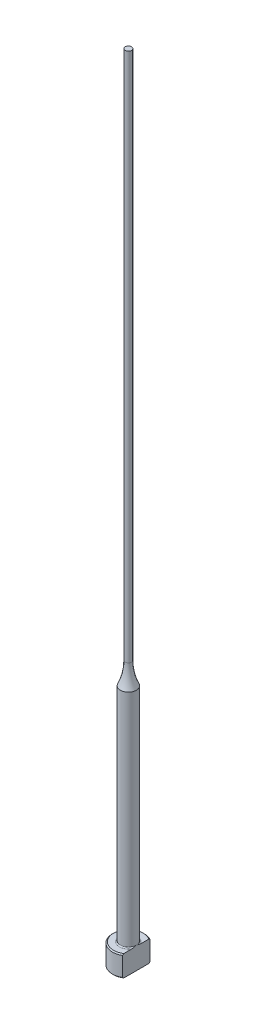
from build123d import *
from build123d.topology import SkipClean

# Parameters (mm, degrees)
CHAMFER1_SIZE    = 0.2
FILLET1_R        = 0.2
KEYED_HEAD_DEPTH = 151.059988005


with BuildPart() as part:
    # Sketch1 → Revolve1 (revolve)
    with BuildSketch(Plane.XY, mode=Mode.PRIVATE) as revolve1_sk:
        with BuildLine():
            Line((0, 0), (-3, 0))
            Line((-3, 0), (-3, 4))
            Line((-3, 4), (-1.5, 4))
            Line((-1.5, 4), (-1.5, 45.853917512))
            ThreePointArc((-1.5, 45.853917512), (-0.827589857, 47.878679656), (-0.6, 50))
            Line((-0.6, 50), (-0.6, 150))
            Line((-0.6, 150), (0, 150))
            Line((0, 150), (0, 0))
        make_face()
    revolve(revolve1_sk.sketch.rotate(Axis((0, 259.958771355, 0), (0, -1, 0)), 270), axis=Axis((0, 259.958771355, 0), (0, -1, 0)))

    # Chamfer1
    chamfer1_edges = [part.edges().sort_by_distance(p)[0] for p in [
        (0, 0, -3),
        (0, 4, -3),
    ]]
    chamfer(chamfer1_edges, length=CHAMFER1_SIZE)

    # Fillet1
    fillet1_edges = [part.edges().sort_by_distance(p)[0] for p in [
        (0, 4, -1.5),
    ]]
    fillet(fillet1_edges, radius=FILLET1_R)

    # Sketch2 → Keyed Head (cut, through all)
    with SkipClean():  # the faces are left unmerged after this step: merging them gives an invalid solid
        with BuildSketch(Plane(origin=(0, 0, 0), x_dir=(1, 0, 0), z_dir=(0, 1, 0))):
            with BuildLine():
                Line((1.5, -2.598076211), (1.5, 2.598076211))
                ThreePointArc((1.5, 2.598076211), (3, 0), (1.5, -2.598076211))
            make_face()
        extrude(amount=KEYED_HEAD_DEPTH, mode=Mode.SUBTRACT)


solid = part.part
